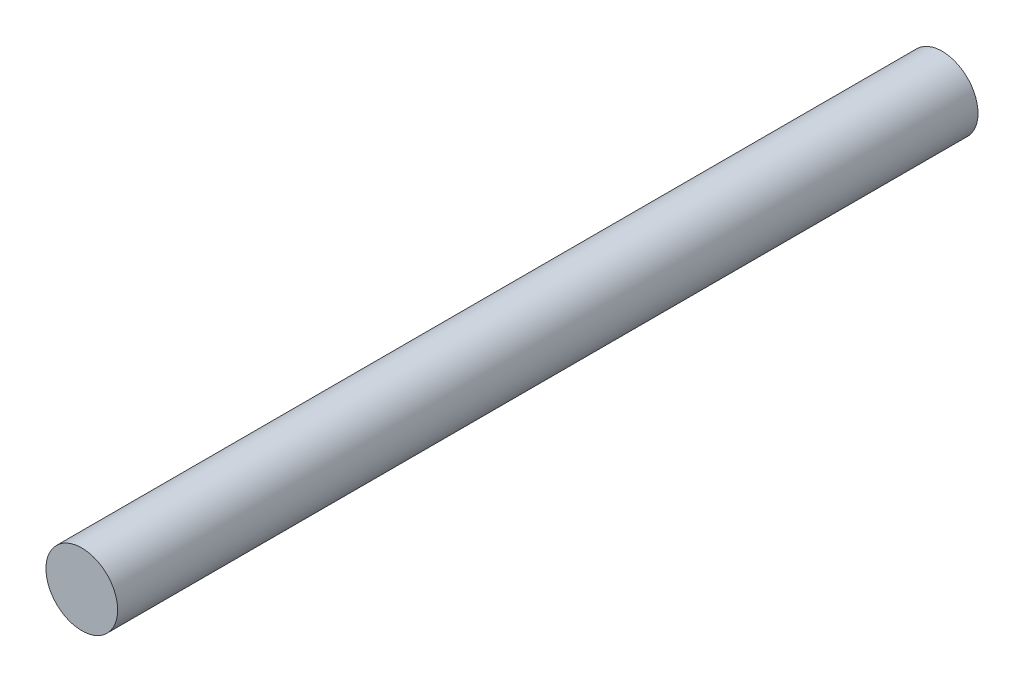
ISO-10303-21;
HEADER;
FILE_DESCRIPTION(('STEP AP214'),'2;1');
FILE_NAME('part.step','',(''),(''),'','','');
FILE_SCHEMA(('AUTOMOTIVE_DESIGN { 1 0 10303 214 1 1 1 1 }'));
ENDSEC;
DATA;
#1=APPLICATION_CONTEXT('core data for automotive mechanical design processes');
#2=APPLICATION_PROTOCOL_DEFINITION('international standard','automotive_design',2000,#1);
#3=PRODUCT_CONTEXT('',#1,'mechanical');
#4=PRODUCT('Part','Part','',(#3));
#5=PRODUCT_RELATED_PRODUCT_CATEGORY('part','',(#4));
#6=PRODUCT_DEFINITION_FORMATION('','',#4);
#7=PRODUCT_DEFINITION_CONTEXT('part definition',#1,'design');
#8=PRODUCT_DEFINITION('design','',#6,#7);
#9=PRODUCT_DEFINITION_SHAPE('','',#8);
#10=(LENGTH_UNIT() NAMED_UNIT(*) SI_UNIT(.MILLI.,.METRE.));
#11=(NAMED_UNIT(*) PLANE_ANGLE_UNIT() SI_UNIT($,.RADIAN.));
#12=(NAMED_UNIT(*) SI_UNIT($,.STERADIAN.) SOLID_ANGLE_UNIT());
#13=UNCERTAINTY_MEASURE_WITH_UNIT(LENGTH_MEASURE(1.E-05),#10,'distance_accuracy_value','');
#14=(GEOMETRIC_REPRESENTATION_CONTEXT(3) GLOBAL_UNCERTAINTY_ASSIGNED_CONTEXT((#13)) GLOBAL_UNIT_ASSIGNED_CONTEXT((#10,
#11,#12)) REPRESENTATION_CONTEXT('',''));
#15=CARTESIAN_POINT('',(0.,0.,0.));
#16=DIRECTION('',(0.,0.,1.));
#17=DIRECTION('',(1.,0.,0.));
#18=AXIS2_PLACEMENT_3D('',#15,#16,#17);
#19=CARTESIAN_POINT('',(0.,0.,49.));
#20=DIRECTION('',(0.,0.,-1.));
#21=DIRECTION('',(-1.,0.,0.));
#22=AXIS2_PLACEMENT_3D('',#19,#20,#21);
#23=CYLINDRICAL_SURFACE('',#22,2.);
#24=CARTESIAN_POINT('',(0.,0.,0.));
#25=DIRECTION('',(0.,0.,1.));
#26=DIRECTION('',(1.,0.,0.));
#27=AXIS2_PLACEMENT_3D('',#24,#25,#26);
#28=CIRCLE('',#27,2.);
#29=CARTESIAN_POINT('',(2.,0.,0.));
#30=VERTEX_POINT('',#29);
#31=EDGE_CURVE('E8',#30,#30,#28,.T.);
#32=ORIENTED_EDGE('',*,*,#31,.T.);
#33=EDGE_LOOP('',(#32));
#34=FACE_BOUND('',#33,.T.);
#35=CARTESIAN_POINT('',(0.,0.,48.));
#36=DIRECTION('',(0.,0.,1.));
#37=DIRECTION('',(1.,0.,0.));
#38=AXIS2_PLACEMENT_3D('',#35,#36,#37);
#39=CIRCLE('',#38,2.);
#40=CARTESIAN_POINT('',(2.,0.,48.));
#41=VERTEX_POINT('',#40);
#42=EDGE_CURVE('E19',#41,#41,#39,.T.);
#43=ORIENTED_EDGE('',*,*,#42,.F.);
#44=EDGE_LOOP('',(#43));
#45=FACE_BOUND('',#44,.T.);
#46=ADVANCED_FACE('F13',(#34,#45),#23,.T.);
#47=CARTESIAN_POINT('',(0.,0.,0.));
#48=DIRECTION('',(0.,0.,1.));
#49=DIRECTION('',(1.,0.,0.));
#50=AXIS2_PLACEMENT_3D('',#47,#48,#49);
#51=PLANE('',#50);
#52=ORIENTED_EDGE('',*,*,#31,.F.);
#53=EDGE_LOOP('',(#52));
#54=FACE_BOUND('',#53,.T.);
#55=ADVANCED_FACE('F28',(#54),#51,.F.);
#56=CARTESIAN_POINT('',(0.,0.,48.));
#57=DIRECTION('',(0.,0.,1.));
#58=DIRECTION('',(1.,0.,0.));
#59=AXIS2_PLACEMENT_3D('',#56,#57,#58);
#60=PLANE('',#59);
#61=ORIENTED_EDGE('',*,*,#42,.T.);
#62=EDGE_LOOP('',(#61));
#63=FACE_BOUND('',#62,.T.);
#64=ADVANCED_FACE('F25',(#63),#60,.T.);
#65=CLOSED_SHELL('',(#46,#55,#64));
#66=MANIFOLD_SOLID_BREP('B1',#65);
#67=ADVANCED_BREP_SHAPE_REPRESENTATION('',(#18,#66),#14);
#68=SHAPE_DEFINITION_REPRESENTATION(#9,#67);
ENDSEC;
END-ISO-10303-21;
